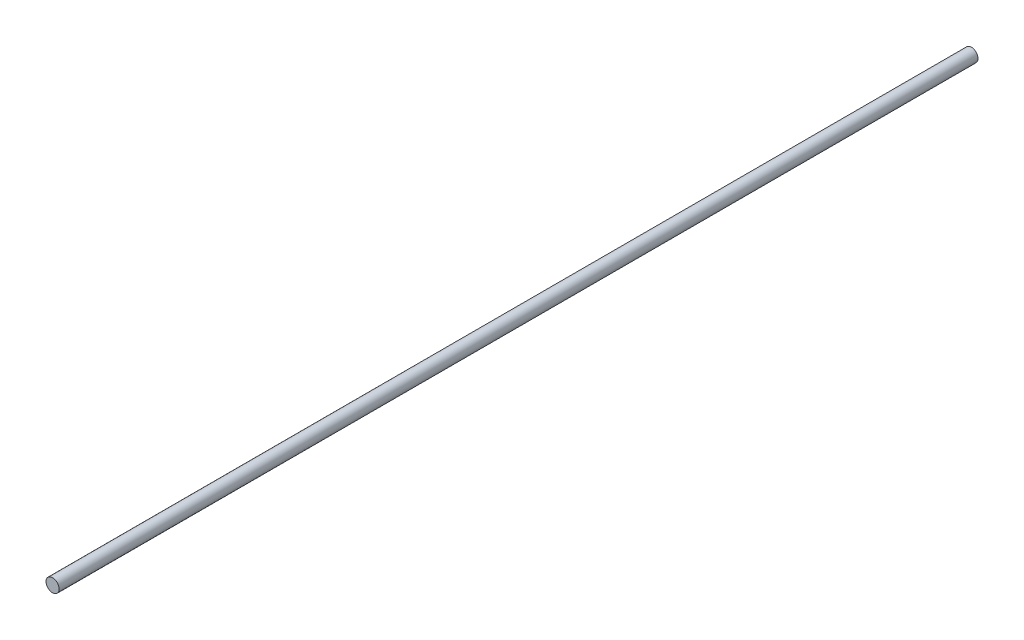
from build123d import *

# Parameters (mm, degrees)
SKETCH1_R           = 30
BOSS_EXTRUDE1_DEPTH = 4200


with BuildPart() as part:
    # Sketch1 → Boss-Extrude1 (new body)
    with BuildSketch(Plane.XY):
        Circle(SKETCH1_R)
    extrude(amount=-BOSS_EXTRUDE1_DEPTH)


solid = part.part
